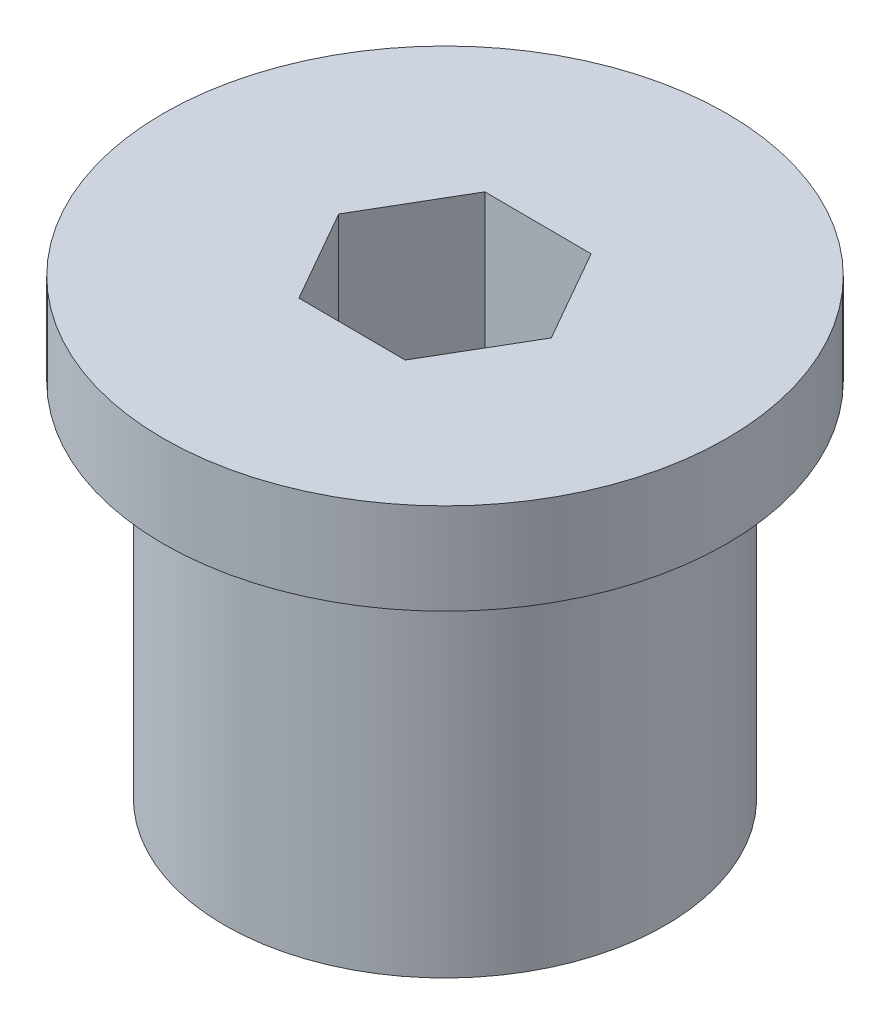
ISO-10303-21;
HEADER;
FILE_DESCRIPTION(('STEP AP214'),'2;1');
FILE_NAME('part.step','',(''),(''),'','','');
FILE_SCHEMA(('AUTOMOTIVE_DESIGN { 1 0 10303 214 1 1 1 1 }'));
ENDSEC;
DATA;
#1=APPLICATION_CONTEXT('core data for automotive mechanical design processes');
#2=APPLICATION_PROTOCOL_DEFINITION('international standard','automotive_design',2000,#1);
#3=PRODUCT_CONTEXT('',#1,'mechanical');
#4=PRODUCT('Part','Part','',(#3));
#5=PRODUCT_RELATED_PRODUCT_CATEGORY('part','',(#4));
#6=PRODUCT_DEFINITION_FORMATION('','',#4);
#7=PRODUCT_DEFINITION_CONTEXT('part definition',#1,'design');
#8=PRODUCT_DEFINITION('design','',#6,#7);
#9=PRODUCT_DEFINITION_SHAPE('','',#8);
#10=(LENGTH_UNIT() NAMED_UNIT(*) SI_UNIT(.MILLI.,.METRE.));
#11=(NAMED_UNIT(*) PLANE_ANGLE_UNIT() SI_UNIT($,.RADIAN.));
#12=(NAMED_UNIT(*) SI_UNIT($,.STERADIAN.) SOLID_ANGLE_UNIT());
#13=UNCERTAINTY_MEASURE_WITH_UNIT(LENGTH_MEASURE(1.E-05),#10,'distance_accuracy_value','');
#14=(GEOMETRIC_REPRESENTATION_CONTEXT(3) GLOBAL_UNCERTAINTY_ASSIGNED_CONTEXT((#13)) GLOBAL_UNIT_ASSIGNED_CONTEXT((#10,
#11,#12)) REPRESENTATION_CONTEXT('',''));
#15=CARTESIAN_POINT('',(0.,0.,0.));
#16=DIRECTION('',(0.,0.,1.));
#17=DIRECTION('',(1.,0.,0.));
#18=AXIS2_PLACEMENT_3D('',#15,#16,#17);
#19=CARTESIAN_POINT('',(0.,0.,0.));
#20=DIRECTION('',(0.,1.,0.));
#21=DIRECTION('',(0.,0.,1.));
#22=AXIS2_PLACEMENT_3D('',#19,#20,#21);
#23=PLANE('',#22);
#24=CARTESIAN_POINT('',(0.,0.,0.));
#25=DIRECTION('',(0.,-1.,0.));
#26=DIRECTION('',(0.,0.,-1.));
#27=AXIS2_PLACEMENT_3D('',#24,#25,#26);
#28=CIRCLE('',#27,5.55625);
#29=CARTESIAN_POINT('',(0.,0.,-5.55625));
#30=VERTEX_POINT('',#29);
#31=EDGE_CURVE('E11',#30,#30,#28,.T.);
#32=ORIENTED_EDGE('',*,*,#31,.T.);
#33=EDGE_LOOP('',(#32));
#34=FACE_BOUND('',#33,.T.);
#35=ADVANCED_FACE('F34',(#34),#23,.F.);
#36=CARTESIAN_POINT('',(0.,0.,0.));
#37=DIRECTION('',(0.,-1.,0.));
#38=DIRECTION('',(0.,0.,-1.));
#39=AXIS2_PLACEMENT_3D('',#36,#37,#38);
#40=CYLINDRICAL_SURFACE('',#39,5.55625);
#41=ORIENTED_EDGE('',*,*,#31,.F.);
#42=EDGE_LOOP('',(#41));
#43=FACE_BOUND('',#42,.T.);
#44=CARTESIAN_POINT('',(0.,9.1,0.));
#45=DIRECTION('',(0.,-1.,0.));
#46=DIRECTION('',(0.,0.,-1.));
#47=AXIS2_PLACEMENT_3D('',#44,#45,#46);
#48=CIRCLE('',#47,5.55625);
#49=CARTESIAN_POINT('',(0.,9.1,-5.55625));
#50=VERTEX_POINT('',#49);
#51=EDGE_CURVE('E41',#50,#50,#48,.T.);
#52=ORIENTED_EDGE('',*,*,#51,.T.);
#53=EDGE_LOOP('',(#52));
#54=FACE_BOUND('',#53,.T.);
#55=ADVANCED_FACE('F148',(#43,#54),#40,.T.);
#56=CARTESIAN_POINT('',(-5.55625,9.1,0.));
#57=DIRECTION('',(0.,1.,0.));
#58=DIRECTION('',(0.,0.,1.));
#59=AXIS2_PLACEMENT_3D('',#56,#57,#58);
#60=PLANE('',#59);
#61=ORIENTED_EDGE('',*,*,#51,.F.);
#62=EDGE_LOOP('',(#61));
#63=FACE_BOUND('',#62,.T.);
#64=CARTESIAN_POINT('',(0.,9.1,0.));
#65=DIRECTION('',(0.,-1.,0.));
#66=DIRECTION('',(0.,0.,-1.));
#67=AXIS2_PLACEMENT_3D('',#64,#65,#66);
#68=CIRCLE('',#67,7.1);
#69=CARTESIAN_POINT('',(0.,9.1,-7.1));
#70=VERTEX_POINT('',#69);
#71=EDGE_CURVE('E143',#70,#70,#68,.T.);
#72=ORIENTED_EDGE('',*,*,#71,.T.);
#73=EDGE_LOOP('',(#72));
#74=FACE_BOUND('',#73,.T.);
#75=ADVANCED_FACE('F150',(#63,#74),#60,.F.);
#76=CARTESIAN_POINT('',(0.,0.,0.));
#77=DIRECTION('',(0.,-1.,0.));
#78=DIRECTION('',(0.,0.,-1.));
#79=AXIS2_PLACEMENT_3D('',#76,#77,#78);
#80=CYLINDRICAL_SURFACE('',#79,7.1);
#81=ORIENTED_EDGE('',*,*,#71,.F.);
#82=EDGE_LOOP('',(#81));
#83=FACE_BOUND('',#82,.T.);
#84=CARTESIAN_POINT('',(0.,11.4,0.));
#85=DIRECTION('',(0.,-1.,0.));
#86=DIRECTION('',(0.,0.,-1.));
#87=AXIS2_PLACEMENT_3D('',#84,#85,#86);
#88=CIRCLE('',#87,7.1);
#89=CARTESIAN_POINT('',(0.,11.4,-7.1));
#90=VERTEX_POINT('',#89);
#91=EDGE_CURVE('E135',#90,#90,#88,.T.);
#92=ORIENTED_EDGE('',*,*,#91,.T.);
#93=EDGE_LOOP('',(#92));
#94=FACE_BOUND('',#93,.T.);
#95=ADVANCED_FACE('F153',(#83,#94),#80,.T.);
#96=CARTESIAN_POINT('',(-7.1,11.4,0.));
#97=DIRECTION('',(0.,-1.,0.));
#98=DIRECTION('',(0.,0.,-1.));
#99=AXIS2_PLACEMENT_3D('',#96,#97,#98);
#100=PLANE('',#99);
#101=DIRECTION('',(-0.495557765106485,0.,-0.868574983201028));
#102=VECTOR('',#101,1.);
#103=CARTESIAN_POINT('',(2.69268176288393,11.4,0.013791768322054));
#104=LINE('',#103,#102);
#105=CARTESIAN_POINT('',(2.69268176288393,11.4,0.0137917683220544));
#106=VERTEX_POINT('',#105);
#107=CARTESIAN_POINT('',(1.35828490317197,11.4,-2.32503492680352));
#108=VERTEX_POINT('',#107);
#109=EDGE_CURVE('E122',#106,#108,#104,.T.);
#110=ORIENTED_EDGE('',*,*,#109,.F.);
#111=DIRECTION('',(0.504429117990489,0.,-0.863453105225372));
#112=VECTOR('',#111,1.);
#113=CARTESIAN_POINT('',(1.33439685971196,11.4,2.33882669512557));
#114=LINE('',#113,#112);
#115=CARTESIAN_POINT('',(1.33439685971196,11.4,2.33882669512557));
#116=VERTEX_POINT('',#115);
#117=EDGE_CURVE('E48',#116,#106,#114,.T.);
#118=ORIENTED_EDGE('',*,*,#117,.F.);
#119=DIRECTION('',(0.999986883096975,0.,0.00512187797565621));
#120=VECTOR('',#119,1.);
#121=CARTESIAN_POINT('',(-1.35828490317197,11.4,2.32503492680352));
#122=LINE('',#121,#120);
#123=CARTESIAN_POINT('',(-1.35828490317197,11.4,2.32503492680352));
#124=VERTEX_POINT('',#123);
#125=EDGE_CURVE('E131',#124,#116,#122,.T.);
#126=ORIENTED_EDGE('',*,*,#125,.F.);
#127=DIRECTION('',(0.495557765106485,0.,0.868574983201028));
#128=VECTOR('',#127,1.);
#129=CARTESIAN_POINT('',(-2.69268176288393,11.4,-0.013791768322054));
#130=LINE('',#129,#128);
#131=CARTESIAN_POINT('',(-2.69268176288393,11.4,-0.013791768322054));
#132=VERTEX_POINT('',#131);
#133=EDGE_CURVE('E129',#132,#124,#130,.T.);
#134=ORIENTED_EDGE('',*,*,#133,.F.);
#135=DIRECTION('',(-0.504429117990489,0.,0.863453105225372));
#136=VECTOR('',#135,1.);
#137=CARTESIAN_POINT('',(-1.33439685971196,11.4,-2.33882669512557));
#138=LINE('',#137,#136);
#139=CARTESIAN_POINT('',(-1.33439685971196,11.4,-2.33882669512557));
#140=VERTEX_POINT('',#139);
#141=EDGE_CURVE('E96',#140,#132,#138,.T.);
#142=ORIENTED_EDGE('',*,*,#141,.F.);
#143=DIRECTION('',(-0.999986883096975,0.,-0.00512187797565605));
#144=VECTOR('',#143,1.);
#145=CARTESIAN_POINT('',(1.35828490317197,11.4,-2.32503492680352));
#146=LINE('',#145,#144);
#147=EDGE_CURVE('E125',#108,#140,#146,.T.);
#148=ORIENTED_EDGE('',*,*,#147,.F.);
#149=EDGE_LOOP('',(#110,#118,#126,#134,#142,#148));
#150=FACE_BOUND('',#149,.T.);
#151=ORIENTED_EDGE('',*,*,#91,.F.);
#152=EDGE_LOOP('',(#151));
#153=FACE_BOUND('',#152,.T.);
#154=ADVANCED_FACE('F159',(#150,#153),#100,.F.);
#155=CARTESIAN_POINT('',(1.33439685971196,5.4,2.33882669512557));
#156=DIRECTION('',(0.863453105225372,0.,0.504429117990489));
#157=DIRECTION('',(0.504429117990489,0.,-0.863453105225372));
#158=AXIS2_PLACEMENT_3D('',#155,#156,#157);
#159=PLANE('',#158);
#160=ORIENTED_EDGE('',*,*,#117,.T.);
#161=DIRECTION('',(0.,1.,0.));
#162=VECTOR('',#161,1.);
#163=CARTESIAN_POINT('',(2.69268176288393,5.4,0.013791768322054));
#164=LINE('',#163,#162);
#165=CARTESIAN_POINT('',(2.69268176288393,5.4,0.013791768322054));
#166=VERTEX_POINT('',#165);
#167=EDGE_CURVE('E78',#166,#106,#164,.T.);
#168=ORIENTED_EDGE('',*,*,#167,.F.);
#169=DIRECTION('',(0.504429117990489,0.,-0.863453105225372));
#170=VECTOR('',#169,1.);
#171=CARTESIAN_POINT('',(1.33439685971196,5.4,2.33882669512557));
#172=LINE('',#171,#170);
#173=CARTESIAN_POINT('',(1.33439685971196,5.4,2.33882669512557));
#174=VERTEX_POINT('',#173);
#175=EDGE_CURVE('E133',#174,#166,#172,.T.);
#176=ORIENTED_EDGE('',*,*,#175,.F.);
#177=DIRECTION('',(0.,1.,0.));
#178=VECTOR('',#177,1.);
#179=CARTESIAN_POINT('',(1.33439685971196,5.4,2.33882669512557));
#180=LINE('',#179,#178);
#181=EDGE_CURVE('E56',#174,#116,#180,.T.);
#182=ORIENTED_EDGE('',*,*,#181,.T.);
#183=EDGE_LOOP('',(#160,#168,#176,#182));
#184=FACE_BOUND('',#183,.T.);
#185=ADVANCED_FACE('F164',(#184),#159,.F.);
#186=CARTESIAN_POINT('',(-1.35828490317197,5.4,2.32503492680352));
#187=DIRECTION('',(-0.00512187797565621,0.,0.999986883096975));
#188=DIRECTION('',(0.999986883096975,0.,0.00512187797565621));
#189=AXIS2_PLACEMENT_3D('',#186,#187,#188);
#190=PLANE('',#189);
#191=ORIENTED_EDGE('',*,*,#125,.T.);
#192=ORIENTED_EDGE('',*,*,#181,.F.);
#193=DIRECTION('',(0.999986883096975,0.,0.00512187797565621));
#194=VECTOR('',#193,1.);
#195=CARTESIAN_POINT('',(-1.35828490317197,5.4,2.32503492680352));
#196=LINE('',#195,#194);
#197=CARTESIAN_POINT('',(-1.35828490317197,5.4,2.32503492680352));
#198=VERTEX_POINT('',#197);
#199=EDGE_CURVE('E108',#198,#174,#196,.T.);
#200=ORIENTED_EDGE('',*,*,#199,.F.);
#201=DIRECTION('',(0.,1.,0.));
#202=VECTOR('',#201,1.);
#203=CARTESIAN_POINT('',(-1.35828490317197,5.4,2.32503492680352));
#204=LINE('',#203,#202);
#205=EDGE_CURVE('E100',#198,#124,#204,.T.);
#206=ORIENTED_EDGE('',*,*,#205,.T.);
#207=EDGE_LOOP('',(#191,#192,#200,#206));
#208=FACE_BOUND('',#207,.T.);
#209=ADVANCED_FACE('F170',(#208),#190,.F.);
#210=CARTESIAN_POINT('',(-2.69268176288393,5.4,-0.013791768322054));
#211=DIRECTION('',(-0.868574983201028,0.,0.495557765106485));
#212=DIRECTION('',(0.495557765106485,0.,0.868574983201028));
#213=AXIS2_PLACEMENT_3D('',#210,#211,#212);
#214=PLANE('',#213);
#215=ORIENTED_EDGE('',*,*,#133,.T.);
#216=ORIENTED_EDGE('',*,*,#205,.F.);
#217=DIRECTION('',(0.495557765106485,0.,0.868574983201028));
#218=VECTOR('',#217,1.);
#219=CARTESIAN_POINT('',(-2.69268176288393,5.4,-0.013791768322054));
#220=LINE('',#219,#218);
#221=CARTESIAN_POINT('',(-2.69268176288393,5.4,-0.013791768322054));
#222=VERTEX_POINT('',#221);
#223=EDGE_CURVE('E104',#222,#198,#220,.T.);
#224=ORIENTED_EDGE('',*,*,#223,.F.);
#225=DIRECTION('',(0.,1.,0.));
#226=VECTOR('',#225,1.);
#227=CARTESIAN_POINT('',(-2.69268176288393,5.4,-0.013791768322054));
#228=LINE('',#227,#226);
#229=EDGE_CURVE('E89',#222,#132,#228,.T.);
#230=ORIENTED_EDGE('',*,*,#229,.T.);
#231=EDGE_LOOP('',(#215,#216,#224,#230));
#232=FACE_BOUND('',#231,.T.);
#233=ADVANCED_FACE('F105',(#232),#214,.F.);
#234=CARTESIAN_POINT('',(-1.33439685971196,5.4,-2.33882669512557));
#235=DIRECTION('',(-0.863453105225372,0.,-0.504429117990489));
#236=DIRECTION('',(-0.504429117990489,0.,0.863453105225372));
#237=AXIS2_PLACEMENT_3D('',#234,#235,#236);
#238=PLANE('',#237);
#239=ORIENTED_EDGE('',*,*,#141,.T.);
#240=ORIENTED_EDGE('',*,*,#229,.F.);
#241=DIRECTION('',(-0.504429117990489,0.,0.863453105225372));
#242=VECTOR('',#241,1.);
#243=CARTESIAN_POINT('',(-1.33439685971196,5.4,-2.33882669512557));
#244=LINE('',#243,#242);
#245=CARTESIAN_POINT('',(-1.33439685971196,5.4,-2.33882669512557));
#246=VERTEX_POINT('',#245);
#247=EDGE_CURVE('E93',#246,#222,#244,.T.);
#248=ORIENTED_EDGE('',*,*,#247,.F.);
#249=DIRECTION('',(0.,1.,0.));
#250=VECTOR('',#249,1.);
#251=CARTESIAN_POINT('',(-1.33439685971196,5.4,-2.33882669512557));
#252=LINE('',#251,#250);
#253=EDGE_CURVE('E101',#246,#140,#252,.T.);
#254=ORIENTED_EDGE('',*,*,#253,.T.);
#255=EDGE_LOOP('',(#239,#240,#248,#254));
#256=FACE_BOUND('',#255,.T.);
#257=ADVANCED_FACE('F91',(#256),#238,.F.);
#258=CARTESIAN_POINT('',(1.35828490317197,5.4,-2.32503492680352));
#259=DIRECTION('',(0.00512187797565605,0.,-0.999986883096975));
#260=DIRECTION('',(-0.999986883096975,0.,-0.00512187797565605));
#261=AXIS2_PLACEMENT_3D('',#258,#259,#260);
#262=PLANE('',#261);
#263=ORIENTED_EDGE('',*,*,#147,.T.);
#264=ORIENTED_EDGE('',*,*,#253,.F.);
#265=DIRECTION('',(-0.999986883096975,0.,-0.00512187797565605));
#266=VECTOR('',#265,1.);
#267=CARTESIAN_POINT('',(1.35828490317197,5.4,-2.32503492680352));
#268=LINE('',#267,#266);
#269=CARTESIAN_POINT('',(1.35828490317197,5.4,-2.32503492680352));
#270=VERTEX_POINT('',#269);
#271=EDGE_CURVE('E114',#270,#246,#268,.T.);
#272=ORIENTED_EDGE('',*,*,#271,.F.);
#273=DIRECTION('',(0.,1.,0.));
#274=VECTOR('',#273,1.);
#275=CARTESIAN_POINT('',(1.35828490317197,5.4,-2.32503492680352));
#276=LINE('',#275,#274);
#277=EDGE_CURVE('E138',#270,#108,#276,.T.);
#278=ORIENTED_EDGE('',*,*,#277,.T.);
#279=EDGE_LOOP('',(#263,#264,#272,#278));
#280=FACE_BOUND('',#279,.T.);
#281=ADVANCED_FACE('F225',(#280),#262,.F.);
#282=CARTESIAN_POINT('',(2.69268176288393,5.4,0.013791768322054));
#283=DIRECTION('',(0.868574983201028,0.,-0.495557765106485));
#284=DIRECTION('',(-0.495557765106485,0.,-0.868574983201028));
#285=AXIS2_PLACEMENT_3D('',#282,#283,#284);
#286=PLANE('',#285);
#287=ORIENTED_EDGE('',*,*,#109,.T.);
#288=ORIENTED_EDGE('',*,*,#277,.F.);
#289=DIRECTION('',(-0.495557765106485,0.,-0.868574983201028));
#290=VECTOR('',#289,1.);
#291=CARTESIAN_POINT('',(2.69268176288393,5.4,0.013791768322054));
#292=LINE('',#291,#290);
#293=EDGE_CURVE('E116',#166,#270,#292,.T.);
#294=ORIENTED_EDGE('',*,*,#293,.F.);
#295=ORIENTED_EDGE('',*,*,#167,.T.);
#296=EDGE_LOOP('',(#287,#288,#294,#295));
#297=FACE_BOUND('',#296,.T.);
#298=ADVANCED_FACE('F234',(#297),#286,.F.);
#299=CARTESIAN_POINT('',(2.69268176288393,5.4,0.0137917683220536));
#300=DIRECTION('',(0.,1.,0.));
#301=DIRECTION('',(0.,0.,1.));
#302=AXIS2_PLACEMENT_3D('',#299,#300,#301);
#303=PLANE('',#302);
#304=ORIENTED_EDGE('',*,*,#175,.T.);
#305=ORIENTED_EDGE('',*,*,#293,.T.);
#306=ORIENTED_EDGE('',*,*,#271,.T.);
#307=ORIENTED_EDGE('',*,*,#247,.T.);
#308=ORIENTED_EDGE('',*,*,#223,.T.);
#309=ORIENTED_EDGE('',*,*,#199,.T.);
#310=EDGE_LOOP('',(#304,#305,#306,#307,#308,#309));
#311=FACE_BOUND('',#310,.T.);
#312=ADVANCED_FACE('F111',(#311),#303,.T.);
#313=CLOSED_SHELL('',(#35,#55,#75,#95,#154,#185,#209,#233,#257,#281,#298,#312));
#314=MANIFOLD_SOLID_BREP('B2',#313);
#315=ADVANCED_BREP_SHAPE_REPRESENTATION('',(#18,#314),#14);
#316=SHAPE_DEFINITION_REPRESENTATION(#9,#315);
ENDSEC;
END-ISO-10303-21;
